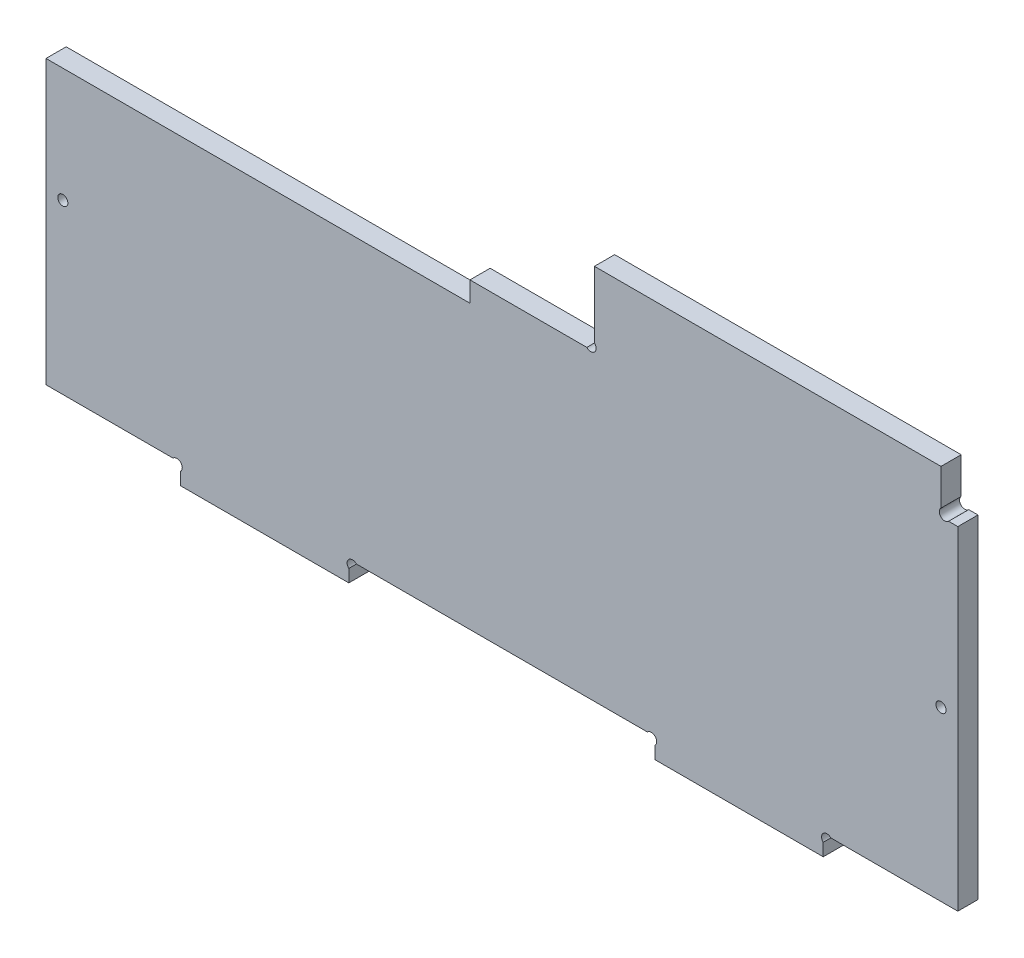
ISO-10303-21;
HEADER;
FILE_DESCRIPTION(('STEP AP214'),'2;1');
FILE_NAME('part.step','',(''),(''),'','','');
FILE_SCHEMA(('AUTOMOTIVE_DESIGN { 1 0 10303 214 1 1 1 1 }'));
ENDSEC;
DATA;
#1=APPLICATION_CONTEXT('core data for automotive mechanical design processes');
#2=APPLICATION_PROTOCOL_DEFINITION('international standard','automotive_design',2000,#1);
#3=PRODUCT_CONTEXT('',#1,'mechanical');
#4=PRODUCT('Part','Part','',(#3));
#5=PRODUCT_RELATED_PRODUCT_CATEGORY('part','',(#4));
#6=PRODUCT_DEFINITION_FORMATION('','',#4);
#7=PRODUCT_DEFINITION_CONTEXT('part definition',#1,'design');
#8=PRODUCT_DEFINITION('design','',#6,#7);
#9=PRODUCT_DEFINITION_SHAPE('','',#8);
#10=(LENGTH_UNIT() NAMED_UNIT(*) SI_UNIT(.MILLI.,.METRE.));
#11=(NAMED_UNIT(*) PLANE_ANGLE_UNIT() SI_UNIT($,.RADIAN.));
#12=(NAMED_UNIT(*) SI_UNIT($,.STERADIAN.) SOLID_ANGLE_UNIT());
#13=UNCERTAINTY_MEASURE_WITH_UNIT(LENGTH_MEASURE(1.E-05),#10,'distance_accuracy_value','');
#14=(GEOMETRIC_REPRESENTATION_CONTEXT(3) GLOBAL_UNCERTAINTY_ASSIGNED_CONTEXT((#13)) GLOBAL_UNIT_ASSIGNED_CONTEXT((#10,
#11,#12)) REPRESENTATION_CONTEXT('',''));
#15=CARTESIAN_POINT('',(0.,0.,0.));
#16=DIRECTION('',(0.,0.,1.));
#17=DIRECTION('',(1.,0.,0.));
#18=AXIS2_PLACEMENT_3D('',#15,#16,#17);
#19=CARTESIAN_POINT('',(0.,0.,6.));
#20=DIRECTION('',(0.,1.,0.));
#21=DIRECTION('',(0.,0.,1.));
#22=AXIS2_PLACEMENT_3D('',#19,#20,#21);
#23=PLANE('',#22);
#24=DIRECTION('',(1.,0.,0.));
#25=VECTOR('',#24,1.);
#26=CARTESIAN_POINT('',(0.,0.,0.));
#27=LINE('',#26,#25);
#28=CARTESIAN_POINT('',(40.,0.,0.));
#29=VERTEX_POINT('',#28);
#30=CARTESIAN_POINT('',(90.,0.,0.));
#31=VERTEX_POINT('',#30);
#32=EDGE_CURVE('E301',#29,#31,#27,.T.);
#33=ORIENTED_EDGE('',*,*,#32,.T.);
#34=DIRECTION('',(0.,0.,1.));
#35=VECTOR('',#34,1.);
#36=CARTESIAN_POINT('',(90.,0.,0.));
#37=LINE('',#36,#35);
#38=CARTESIAN_POINT('',(90.,0.,6.));
#39=VERTEX_POINT('',#38);
#40=EDGE_CURVE('E356',#31,#39,#37,.T.);
#41=ORIENTED_EDGE('',*,*,#40,.T.);
#42=DIRECTION('',(1.,0.,0.));
#43=VECTOR('',#42,1.);
#44=CARTESIAN_POINT('',(0.,0.,6.));
#45=LINE('',#44,#43);
#46=CARTESIAN_POINT('',(40.,0.,6.));
#47=VERTEX_POINT('',#46);
#48=EDGE_CURVE('E223',#47,#39,#45,.T.);
#49=ORIENTED_EDGE('',*,*,#48,.F.);
#50=DIRECTION('',(0.,0.,1.));
#51=VECTOR('',#50,1.);
#52=CARTESIAN_POINT('',(40.,0.,0.));
#53=LINE('',#52,#51);
#54=EDGE_CURVE('E341',#29,#47,#53,.T.);
#55=ORIENTED_EDGE('',*,*,#54,.F.);
#56=EDGE_LOOP('',(#33,#41,#49,#55));
#57=FACE_BOUND('',#56,.T.);
#58=ADVANCED_FACE('F32',(#57),#23,.F.);
#59=CARTESIAN_POINT('',(0.,0.,6.));
#60=DIRECTION('',(1.,0.,0.));
#61=DIRECTION('',(0.,0.,-1.));
#62=AXIS2_PLACEMENT_3D('',#59,#60,#61);
#63=PLANE('',#62);
#64=DIRECTION('',(0.,-1.,0.));
#65=VECTOR('',#64,1.);
#66=CARTESIAN_POINT('',(0.,0.,0.));
#67=LINE('',#66,#65);
#68=CARTESIAN_POINT('',(0.,90.,0.));
#69=VERTEX_POINT('',#68);
#70=CARTESIAN_POINT('',(0.,6.,0.));
#71=VERTEX_POINT('',#70);
#72=EDGE_CURVE('E296',#69,#71,#67,.T.);
#73=ORIENTED_EDGE('',*,*,#72,.T.);
#74=DIRECTION('',(0.,0.,1.));
#75=VECTOR('',#74,1.);
#76=CARTESIAN_POINT('',(0.,6.,0.));
#77=LINE('',#76,#75);
#78=CARTESIAN_POINT('',(0.,6.,6.));
#79=VERTEX_POINT('',#78);
#80=EDGE_CURVE('E339',#71,#79,#77,.T.);
#81=ORIENTED_EDGE('',*,*,#80,.T.);
#82=DIRECTION('',(0.,-1.,0.));
#83=VECTOR('',#82,1.);
#84=CARTESIAN_POINT('',(0.,0.,6.));
#85=LINE('',#84,#83);
#86=CARTESIAN_POINT('',(0.,90.,6.));
#87=VERTEX_POINT('',#86);
#88=EDGE_CURVE('E219',#87,#79,#85,.T.);
#89=ORIENTED_EDGE('',*,*,#88,.F.);
#90=DIRECTION('',(0.,0.,-1.));
#91=VECTOR('',#90,1.);
#92=CARTESIAN_POINT('',(0.,90.,6.));
#93=LINE('',#92,#91);
#94=EDGE_CURVE('E243',#87,#69,#93,.T.);
#95=ORIENTED_EDGE('',*,*,#94,.T.);
#96=EDGE_LOOP('',(#73,#81,#89,#95));
#97=FACE_BOUND('',#96,.T.);
#98=ADVANCED_FACE('F34',(#97),#63,.F.);
#99=CARTESIAN_POINT('',(181.,0.,6.));
#100=VERTEX_POINT('',#99);
#101=CARTESIAN_POINT('',(231.,0.,6.));
#102=VERTEX_POINT('',#101);
#103=EDGE_CURVE('E222',#100,#102,#45,.T.);
#104=ORIENTED_EDGE('',*,*,#103,.F.);
#105=DIRECTION('',(0.,0.,1.));
#106=VECTOR('',#105,1.);
#107=CARTESIAN_POINT('',(181.,0.,0.));
#108=LINE('',#107,#106);
#109=CARTESIAN_POINT('',(181.,0.,0.));
#110=VERTEX_POINT('',#109);
#111=EDGE_CURVE('E355',#110,#100,#108,.T.);
#112=ORIENTED_EDGE('',*,*,#111,.F.);
#113=CARTESIAN_POINT('',(231.,0.,0.));
#114=VERTEX_POINT('',#113);
#115=EDGE_CURVE('E300',#110,#114,#27,.T.);
#116=ORIENTED_EDGE('',*,*,#115,.T.);
#117=DIRECTION('',(0.,0.,1.));
#118=VECTOR('',#117,1.);
#119=CARTESIAN_POINT('',(231.,0.,0.));
#120=LINE('',#119,#118);
#121=EDGE_CURVE('E293',#114,#102,#120,.T.);
#122=ORIENTED_EDGE('',*,*,#121,.T.);
#123=EDGE_LOOP('',(#104,#112,#116,#122));
#124=FACE_BOUND('',#123,.T.);
#125=ADVANCED_FACE('F444',(#124),#23,.F.);
#126=CARTESIAN_POINT('',(271.,0.,6.));
#127=DIRECTION('',(-1.,0.,0.));
#128=DIRECTION('',(0.,0.,1.));
#129=AXIS2_PLACEMENT_3D('',#126,#127,#128);
#130=PLANE('',#129);
#131=DIRECTION('',(0.,1.,0.));
#132=VECTOR('',#131,1.);
#133=CARTESIAN_POINT('',(271.,0.,6.));
#134=LINE('',#133,#132);
#135=CARTESIAN_POINT('',(271.,6.,6.));
#136=VERTEX_POINT('',#135);
#137=CARTESIAN_POINT('',(271.,105.,6.));
#138=VERTEX_POINT('',#137);
#139=EDGE_CURVE('E226',#136,#138,#134,.T.);
#140=ORIENTED_EDGE('',*,*,#139,.F.);
#141=DIRECTION('',(0.,0.,1.));
#142=VECTOR('',#141,1.);
#143=CARTESIAN_POINT('',(271.,6.,0.));
#144=LINE('',#143,#142);
#145=CARTESIAN_POINT('',(271.,6.,0.));
#146=VERTEX_POINT('',#145);
#147=EDGE_CURVE('E288',#146,#136,#144,.T.);
#148=ORIENTED_EDGE('',*,*,#147,.F.);
#149=DIRECTION('',(0.,1.,0.));
#150=VECTOR('',#149,1.);
#151=CARTESIAN_POINT('',(271.,0.,0.));
#152=LINE('',#151,#150);
#153=CARTESIAN_POINT('',(271.,105.,0.));
#154=VERTEX_POINT('',#153);
#155=EDGE_CURVE('E284',#146,#154,#152,.T.);
#156=ORIENTED_EDGE('',*,*,#155,.T.);
#157=DIRECTION('',(0.,0.,-1.));
#158=VECTOR('',#157,1.);
#159=CARTESIAN_POINT('',(271.,105.,6.));
#160=LINE('',#159,#158);
#161=EDGE_CURVE('E257',#138,#154,#160,.T.);
#162=ORIENTED_EDGE('',*,*,#161,.F.);
#163=EDGE_LOOP('',(#140,#148,#156,#162));
#164=FACE_BOUND('',#163,.T.);
#165=ADVANCED_FACE('F336',(#164),#130,.F.);
#166=CARTESIAN_POINT('',(271.,105.,6.));
#167=DIRECTION('',(0.,-1.,0.));
#168=DIRECTION('',(0.,0.,-1.));
#169=AXIS2_PLACEMENT_3D('',#166,#167,#168);
#170=PLANE('',#169);
#171=DIRECTION('',(-1.,0.,0.));
#172=VECTOR('',#171,1.);
#173=CARTESIAN_POINT('',(271.,105.,0.));
#174=LINE('',#173,#172);
#175=CARTESIAN_POINT('',(268.261895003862,105.,0.));
#176=VERTEX_POINT('',#175);
#177=EDGE_CURVE('E305',#154,#176,#174,.T.);
#178=ORIENTED_EDGE('',*,*,#177,.T.);
#179=DIRECTION('',(0.,0.,1.));
#180=VECTOR('',#179,1.);
#181=CARTESIAN_POINT('',(268.261895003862,105.,0.));
#182=LINE('',#181,#180);
#183=CARTESIAN_POINT('',(268.261895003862,105.,6.));
#184=VERTEX_POINT('',#183);
#185=EDGE_CURVE('E54',#176,#184,#182,.T.);
#186=ORIENTED_EDGE('',*,*,#185,.T.);
#187=DIRECTION('',(-1.,0.,0.));
#188=VECTOR('',#187,1.);
#189=CARTESIAN_POINT('',(271.,105.,6.));
#190=LINE('',#189,#188);
#191=EDGE_CURVE('E228',#138,#184,#190,.T.);
#192=ORIENTED_EDGE('',*,*,#191,.F.);
#193=ORIENTED_EDGE('',*,*,#161,.T.);
#194=EDGE_LOOP('',(#178,#186,#192,#193));
#195=FACE_BOUND('',#194,.T.);
#196=ADVANCED_FACE('F331',(#195),#170,.F.);
#197=CARTESIAN_POINT('',(266.,105.,6.));
#198=DIRECTION('',(-1.,0.,0.));
#199=DIRECTION('',(0.,0.,1.));
#200=AXIS2_PLACEMENT_3D('',#197,#198,#199);
#201=PLANE('',#200);
#202=DIRECTION('',(0.,1.,0.));
#203=VECTOR('',#202,1.);
#204=CARTESIAN_POINT('',(266.,105.,6.));
#205=LINE('',#204,#203);
#206=CARTESIAN_POINT('',(266.,107.261895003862,6.));
#207=VERTEX_POINT('',#206);
#208=CARTESIAN_POINT('',(266.,118.,6.));
#209=VERTEX_POINT('',#208);
#210=EDGE_CURVE('E231',#207,#209,#205,.T.);
#211=ORIENTED_EDGE('',*,*,#210,.F.);
#212=DIRECTION('',(0.,0.,1.));
#213=VECTOR('',#212,1.);
#214=CARTESIAN_POINT('',(266.,107.261895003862,0.));
#215=LINE('',#214,#213);
#216=CARTESIAN_POINT('',(266.,107.261895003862,0.));
#217=VERTEX_POINT('',#216);
#218=EDGE_CURVE('E327',#207,#217,#215,.F.);
#219=ORIENTED_EDGE('',*,*,#218,.T.);
#220=DIRECTION('',(0.,1.,0.));
#221=VECTOR('',#220,1.);
#222=CARTESIAN_POINT('',(266.,105.,0.));
#223=LINE('',#222,#221);
#224=CARTESIAN_POINT('',(266.,118.,0.));
#225=VERTEX_POINT('',#224);
#226=EDGE_CURVE('E308',#217,#225,#223,.T.);
#227=ORIENTED_EDGE('',*,*,#226,.T.);
#228=DIRECTION('',(0.,0.,-1.));
#229=VECTOR('',#228,1.);
#230=CARTESIAN_POINT('',(266.,118.,6.));
#231=LINE('',#230,#229);
#232=EDGE_CURVE('E254',#209,#225,#231,.T.);
#233=ORIENTED_EDGE('',*,*,#232,.F.);
#234=EDGE_LOOP('',(#211,#219,#227,#233));
#235=FACE_BOUND('',#234,.T.);
#236=ADVANCED_FACE('F326',(#235),#201,.F.);
#237=CARTESIAN_POINT('',(266.,118.,6.));
#238=DIRECTION('',(0.,-1.,0.));
#239=DIRECTION('',(1.,0.,0.));
#240=AXIS2_PLACEMENT_3D('',#237,#238,#239);
#241=PLANE('',#240);
#242=DIRECTION('',(-1.,0.,0.));
#243=VECTOR('',#242,1.);
#244=CARTESIAN_POINT('',(266.,118.,0.));
#245=LINE('',#244,#243);
#246=CARTESIAN_POINT('',(163.,118.,0.));
#247=VERTEX_POINT('',#246);
#248=EDGE_CURVE('E214',#225,#247,#245,.T.);
#249=ORIENTED_EDGE('',*,*,#248,.T.);
#250=DIRECTION('',(0.,0.,-1.));
#251=VECTOR('',#250,1.);
#252=CARTESIAN_POINT('',(163.,118.,6.));
#253=LINE('',#252,#251);
#254=CARTESIAN_POINT('',(163.,118.,6.));
#255=VERTEX_POINT('',#254);
#256=EDGE_CURVE('E251',#255,#247,#253,.T.);
#257=ORIENTED_EDGE('',*,*,#256,.F.);
#258=DIRECTION('',(-1.,0.,0.));
#259=VECTOR('',#258,1.);
#260=CARTESIAN_POINT('',(266.,118.,6.));
#261=LINE('',#260,#259);
#262=EDGE_CURVE('E233',#209,#255,#261,.T.);
#263=ORIENTED_EDGE('',*,*,#262,.F.);
#264=ORIENTED_EDGE('',*,*,#232,.T.);
#265=EDGE_LOOP('',(#249,#257,#263,#264));
#266=FACE_BOUND('',#265,.T.);
#267=ADVANCED_FACE('F312',(#266),#241,.F.);
#268=CARTESIAN_POINT('',(163.,118.,6.));
#269=DIRECTION('',(1.,0.,0.));
#270=DIRECTION('',(0.,0.,-1.));
#271=AXIS2_PLACEMENT_3D('',#268,#269,#270);
#272=PLANE('',#271);
#273=DIRECTION('',(0.,-1.,0.));
#274=VECTOR('',#273,1.);
#275=CARTESIAN_POINT('',(163.,118.,0.));
#276=LINE('',#275,#274);
#277=CARTESIAN_POINT('',(163.,98.2618950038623,0.));
#278=VERTEX_POINT('',#277);
#279=EDGE_CURVE('E210',#247,#278,#276,.T.);
#280=ORIENTED_EDGE('',*,*,#279,.T.);
#281=DIRECTION('',(0.,0.,1.));
#282=VECTOR('',#281,1.);
#283=CARTESIAN_POINT('',(163.,98.2618950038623,0.));
#284=LINE('',#283,#282);
#285=CARTESIAN_POINT('',(163.,98.2618950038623,6.));
#286=VERTEX_POINT('',#285);
#287=EDGE_CURVE('E47',#278,#286,#284,.T.);
#288=ORIENTED_EDGE('',*,*,#287,.T.);
#289=DIRECTION('',(0.,-1.,0.));
#290=VECTOR('',#289,1.);
#291=CARTESIAN_POINT('',(163.,118.,6.));
#292=LINE('',#291,#290);
#293=EDGE_CURVE('E235',#255,#286,#292,.T.);
#294=ORIENTED_EDGE('',*,*,#293,.F.);
#295=ORIENTED_EDGE('',*,*,#256,.T.);
#296=EDGE_LOOP('',(#280,#288,#294,#295));
#297=FACE_BOUND('',#296,.T.);
#298=ADVANCED_FACE('F318',(#297),#272,.F.);
#299=CARTESIAN_POINT('',(163.,96.,6.));
#300=DIRECTION('',(0.,-1.,0.));
#301=DIRECTION('',(0.,0.,-1.));
#302=AXIS2_PLACEMENT_3D('',#299,#300,#301);
#303=PLANE('',#302);
#304=DIRECTION('',(-1.,0.,0.));
#305=VECTOR('',#304,1.);
#306=CARTESIAN_POINT('',(163.,96.,6.));
#307=LINE('',#306,#305);
#308=CARTESIAN_POINT('',(160.738104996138,96.,6.));
#309=VERTEX_POINT('',#308);
#310=CARTESIAN_POINT('',(126.,96.,6.));
#311=VERTEX_POINT('',#310);
#312=EDGE_CURVE('E203',#309,#311,#307,.T.);
#313=ORIENTED_EDGE('',*,*,#312,.F.);
#314=DIRECTION('',(0.,0.,1.));
#315=VECTOR('',#314,1.);
#316=CARTESIAN_POINT('',(160.738104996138,96.,0.));
#317=LINE('',#316,#315);
#318=CARTESIAN_POINT('',(160.738104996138,96.,0.));
#319=VERTEX_POINT('',#318);
#320=EDGE_CURVE('E191',#309,#319,#317,.F.);
#321=ORIENTED_EDGE('',*,*,#320,.T.);
#322=DIRECTION('',(-1.,0.,0.));
#323=VECTOR('',#322,1.);
#324=CARTESIAN_POINT('',(163.,96.,0.));
#325=LINE('',#324,#323);
#326=CARTESIAN_POINT('',(126.,96.,0.));
#327=VERTEX_POINT('',#326);
#328=EDGE_CURVE('E201',#319,#327,#325,.T.);
#329=ORIENTED_EDGE('',*,*,#328,.T.);
#330=DIRECTION('',(0.,0.,-1.));
#331=VECTOR('',#330,1.);
#332=CARTESIAN_POINT('',(126.,96.,6.));
#333=LINE('',#332,#331);
#334=EDGE_CURVE('E249',#311,#327,#333,.T.);
#335=ORIENTED_EDGE('',*,*,#334,.F.);
#336=EDGE_LOOP('',(#313,#321,#329,#335));
#337=FACE_BOUND('',#336,.T.);
#338=ADVANCED_FACE('F199',(#337),#303,.F.);
#339=CARTESIAN_POINT('',(126.,96.,6.));
#340=DIRECTION('',(1.,0.,0.));
#341=DIRECTION('',(0.,0.,-1.));
#342=AXIS2_PLACEMENT_3D('',#339,#340,#341);
#343=PLANE('',#342);
#344=DIRECTION('',(0.,-1.,0.));
#345=VECTOR('',#344,1.);
#346=CARTESIAN_POINT('',(126.,96.,0.));
#347=LINE('',#346,#345);
#348=CARTESIAN_POINT('',(126.,90.,0.));
#349=VERTEX_POINT('',#348);
#350=EDGE_CURVE('E209',#327,#349,#347,.T.);
#351=ORIENTED_EDGE('',*,*,#350,.T.);
#352=DIRECTION('',(0.,0.,-1.));
#353=VECTOR('',#352,1.);
#354=CARTESIAN_POINT('',(126.,90.,6.));
#355=LINE('',#354,#353);
#356=CARTESIAN_POINT('',(126.,90.,6.));
#357=VERTEX_POINT('',#356);
#358=EDGE_CURVE('E246',#357,#349,#355,.T.);
#359=ORIENTED_EDGE('',*,*,#358,.F.);
#360=DIRECTION('',(0.,-1.,0.));
#361=VECTOR('',#360,1.);
#362=CARTESIAN_POINT('',(126.,96.,6.));
#363=LINE('',#362,#361);
#364=EDGE_CURVE('E239',#311,#357,#363,.T.);
#365=ORIENTED_EDGE('',*,*,#364,.F.);
#366=ORIENTED_EDGE('',*,*,#334,.T.);
#367=EDGE_LOOP('',(#351,#359,#365,#366));
#368=FACE_BOUND('',#367,.T.);
#369=ADVANCED_FACE('F516',(#368),#343,.F.);
#370=CARTESIAN_POINT('',(126.,90.,6.));
#371=DIRECTION('',(0.,-1.,0.));
#372=DIRECTION('',(0.,0.,-1.));
#373=AXIS2_PLACEMENT_3D('',#370,#371,#372);
#374=PLANE('',#373);
#375=DIRECTION('',(-1.,0.,0.));
#376=VECTOR('',#375,1.);
#377=CARTESIAN_POINT('',(126.,90.,0.));
#378=LINE('',#377,#376);
#379=EDGE_CURVE('E212',#349,#69,#378,.T.);
#380=ORIENTED_EDGE('',*,*,#379,.T.);
#381=ORIENTED_EDGE('',*,*,#94,.F.);
#382=DIRECTION('',(-1.,0.,0.));
#383=VECTOR('',#382,1.);
#384=CARTESIAN_POINT('',(126.,90.,6.));
#385=LINE('',#384,#383);
#386=EDGE_CURVE('E241',#357,#87,#385,.T.);
#387=ORIENTED_EDGE('',*,*,#386,.F.);
#388=ORIENTED_EDGE('',*,*,#358,.T.);
#389=EDGE_LOOP('',(#380,#381,#387,#388));
#390=FACE_BOUND('',#389,.T.);
#391=ADVANCED_FACE('F425',(#390),#374,.F.);
#392=CARTESIAN_POINT('',(0.,90.,6.));
#393=DIRECTION('',(0.,0.,1.));
#394=DIRECTION('',(1.,0.,0.));
#395=AXIS2_PLACEMENT_3D('',#392,#393,#394);
#396=PLANE('',#395);
#397=CARTESIAN_POINT('',(5.,56.,6.));
#398=DIRECTION('',(0.,0.,1.));
#399=DIRECTION('',(1.,0.,0.));
#400=AXIS2_PLACEMENT_3D('',#397,#398,#399);
#401=CIRCLE('',#400,1.5);
#402=CARTESIAN_POINT('',(6.5,56.,6.));
#403=VERTEX_POINT('',#402);
#404=EDGE_CURVE('E417',#403,#403,#401,.T.);
#405=ORIENTED_EDGE('',*,*,#404,.F.);
#406=EDGE_LOOP('',(#405));
#407=FACE_BOUND('',#406,.T.);
#408=CARTESIAN_POINT('',(266.,56.,6.));
#409=DIRECTION('',(0.,0.,1.));
#410=DIRECTION('',(1.,0.,0.));
#411=AXIS2_PLACEMENT_3D('',#408,#409,#410);
#412=CIRCLE('',#411,1.50000000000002);
#413=CARTESIAN_POINT('',(267.5,56.,6.));
#414=VERTEX_POINT('',#413);
#415=EDGE_CURVE('E411',#414,#414,#412,.T.);
#416=ORIENTED_EDGE('',*,*,#415,.F.);
#417=EDGE_LOOP('',(#416));
#418=FACE_BOUND('',#417,.T.);
#419=CARTESIAN_POINT('',(161.9,97.1,6.));
#420=DIRECTION('',(0.,0.,1.));
#421=DIRECTION('',(1.,0.,0.));
#422=AXIS2_PLACEMENT_3D('',#419,#420,#421);
#423=CIRCLE('',#422,1.59999999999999);
#424=EDGE_CURVE('E204',#309,#286,#423,.T.);
#425=ORIENTED_EDGE('',*,*,#424,.F.);
#426=ORIENTED_EDGE('',*,*,#312,.T.);
#427=ORIENTED_EDGE('',*,*,#364,.T.);
#428=ORIENTED_EDGE('',*,*,#386,.T.);
#429=ORIENTED_EDGE('',*,*,#88,.T.);
#430=DIRECTION('',(-1.,0.,0.));
#431=VECTOR('',#430,1.);
#432=CARTESIAN_POINT('',(0.,6.,6.));
#433=LINE('',#432,#431);
#434=CARTESIAN_POINT('',(37.7381049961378,6.,6.));
#435=VERTEX_POINT('',#434);
#436=EDGE_CURVE('E350',#435,#79,#433,.T.);
#437=ORIENTED_EDGE('',*,*,#436,.F.);
#438=CARTESIAN_POINT('',(38.9,4.9,6.));
#439=DIRECTION('',(0.,0.,1.));
#440=DIRECTION('',(1.,0.,0.));
#441=AXIS2_PLACEMENT_3D('',#438,#439,#440);
#442=CIRCLE('',#441,1.6);
#443=CARTESIAN_POINT('',(40.,3.73810499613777,6.));
#444=VERTEX_POINT('',#443);
#445=EDGE_CURVE('E380',#444,#435,#442,.T.);
#446=ORIENTED_EDGE('',*,*,#445,.F.);
#447=DIRECTION('',(0.,1.,0.));
#448=VECTOR('',#447,1.);
#449=CARTESIAN_POINT('',(40.,0.,6.));
#450=LINE('',#449,#448);
#451=EDGE_CURVE('E352',#47,#444,#450,.T.);
#452=ORIENTED_EDGE('',*,*,#451,.F.);
#453=ORIENTED_EDGE('',*,*,#48,.T.);
#454=DIRECTION('',(0.,-1.,0.));
#455=VECTOR('',#454,1.);
#456=CARTESIAN_POINT('',(90.,6.,6.));
#457=LINE('',#456,#455);
#458=CARTESIAN_POINT('',(90.,3.73810499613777,6.));
#459=VERTEX_POINT('',#458);
#460=EDGE_CURVE('E372',#459,#39,#457,.T.);
#461=ORIENTED_EDGE('',*,*,#460,.F.);
#462=CARTESIAN_POINT('',(91.1,4.9,6.));
#463=DIRECTION('',(0.,0.,1.));
#464=DIRECTION('',(1.,0.,0.));
#465=AXIS2_PLACEMENT_3D('',#462,#463,#464);
#466=CIRCLE('',#465,1.60000000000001);
#467=CARTESIAN_POINT('',(92.2618950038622,6.,6.));
#468=VERTEX_POINT('',#467);
#469=EDGE_CURVE('E388',#468,#459,#466,.T.);
#470=ORIENTED_EDGE('',*,*,#469,.F.);
#471=DIRECTION('',(-1.,0.,0.));
#472=VECTOR('',#471,1.);
#473=CARTESIAN_POINT('',(90.,6.,6.));
#474=LINE('',#473,#472);
#475=CARTESIAN_POINT('',(178.738104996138,6.,6.));
#476=VERTEX_POINT('',#475);
#477=EDGE_CURVE('E367',#476,#468,#474,.T.);
#478=ORIENTED_EDGE('',*,*,#477,.F.);
#479=CARTESIAN_POINT('',(179.9,4.9,6.));
#480=DIRECTION('',(0.,0.,1.));
#481=DIRECTION('',(1.,0.,0.));
#482=AXIS2_PLACEMENT_3D('',#479,#480,#481);
#483=CIRCLE('',#482,1.59999999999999);
#484=CARTESIAN_POINT('',(181.,3.73810499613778,6.));
#485=VERTEX_POINT('',#484);
#486=EDGE_CURVE('E396',#485,#476,#483,.T.);
#487=ORIENTED_EDGE('',*,*,#486,.F.);
#488=DIRECTION('',(0.,1.,0.));
#489=VECTOR('',#488,1.);
#490=CARTESIAN_POINT('',(181.,6.,6.));
#491=LINE('',#490,#489);
#492=EDGE_CURVE('E369',#100,#485,#491,.T.);
#493=ORIENTED_EDGE('',*,*,#492,.F.);
#494=ORIENTED_EDGE('',*,*,#103,.T.);
#495=DIRECTION('',(0.,-1.,0.));
#496=VECTOR('',#495,1.);
#497=CARTESIAN_POINT('',(231.,0.,6.));
#498=LINE('',#497,#496);
#499=CARTESIAN_POINT('',(231.,3.73810499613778,6.));
#500=VERTEX_POINT('',#499);
#501=EDGE_CURVE('E286',#500,#102,#498,.T.);
#502=ORIENTED_EDGE('',*,*,#501,.F.);
#503=CARTESIAN_POINT('',(232.1,4.9,6.));
#504=DIRECTION('',(0.,0.,1.));
#505=DIRECTION('',(1.,0.,0.));
#506=AXIS2_PLACEMENT_3D('',#503,#504,#505);
#507=CIRCLE('',#506,1.59999999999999);
#508=CARTESIAN_POINT('',(233.261895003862,5.99999999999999,6.));
#509=VERTEX_POINT('',#508);
#510=EDGE_CURVE('E338',#509,#500,#507,.T.);
#511=ORIENTED_EDGE('',*,*,#510,.F.);
#512=DIRECTION('',(-1.,0.,0.));
#513=VECTOR('',#512,1.);
#514=CARTESIAN_POINT('',(271.,6.,6.));
#515=LINE('',#514,#513);
#516=EDGE_CURVE('E276',#136,#509,#515,.T.);
#517=ORIENTED_EDGE('',*,*,#516,.F.);
#518=ORIENTED_EDGE('',*,*,#139,.T.);
#519=ORIENTED_EDGE('',*,*,#191,.T.);
#520=CARTESIAN_POINT('',(267.1,106.1,6.));
#521=DIRECTION('',(0.,0.,1.));
#522=DIRECTION('',(1.,0.,0.));
#523=AXIS2_PLACEMENT_3D('',#520,#521,#522);
#524=CIRCLE('',#523,1.59999999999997);
#525=EDGE_CURVE('E323',#207,#184,#524,.T.);
#526=ORIENTED_EDGE('',*,*,#525,.F.);
#527=ORIENTED_EDGE('',*,*,#210,.T.);
#528=ORIENTED_EDGE('',*,*,#262,.T.);
#529=ORIENTED_EDGE('',*,*,#293,.T.);
#530=EDGE_LOOP('',(#425,#426,#427,#428,#429,#437,#446,#452,#453,#461,#470,#478,#487,#493,#494,
#502,#511,#517,#518,#519,#526,#527,#528,#529));
#531=FACE_BOUND('',#530,.T.);
#532=ADVANCED_FACE('F320',(#407,#418,#531),#396,.T.);
#533=CARTESIAN_POINT('',(0.,90.,0.));
#534=DIRECTION('',(0.,0.,1.));
#535=DIRECTION('',(1.,0.,0.));
#536=AXIS2_PLACEMENT_3D('',#533,#534,#535);
#537=PLANE('',#536);
#538=CARTESIAN_POINT('',(5.,56.,0.));
#539=DIRECTION('',(0.,0.,1.));
#540=DIRECTION('',(1.,0.,0.));
#541=AXIS2_PLACEMENT_3D('',#538,#539,#540);
#542=CIRCLE('',#541,1.5);
#543=CARTESIAN_POINT('',(6.5,56.,0.));
#544=VERTEX_POINT('',#543);
#545=EDGE_CURVE('E414',#544,#544,#542,.T.);
#546=ORIENTED_EDGE('',*,*,#545,.T.);
#547=EDGE_LOOP('',(#546));
#548=FACE_BOUND('',#547,.T.);
#549=CARTESIAN_POINT('',(266.,56.,0.));
#550=DIRECTION('',(0.,0.,1.));
#551=DIRECTION('',(1.,0.,0.));
#552=AXIS2_PLACEMENT_3D('',#549,#550,#551);
#553=CIRCLE('',#552,1.50000000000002);
#554=CARTESIAN_POINT('',(267.5,56.,0.));
#555=VERTEX_POINT('',#554);
#556=EDGE_CURVE('E408',#555,#555,#553,.T.);
#557=ORIENTED_EDGE('',*,*,#556,.T.);
#558=EDGE_LOOP('',(#557));
#559=FACE_BOUND('',#558,.T.);
#560=ORIENTED_EDGE('',*,*,#328,.F.);
#561=CARTESIAN_POINT('',(161.9,97.1,0.));
#562=DIRECTION('',(0.,0.,1.));
#563=DIRECTION('',(1.,0.,0.));
#564=AXIS2_PLACEMENT_3D('',#561,#562,#563);
#565=CIRCLE('',#564,1.59999999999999);
#566=EDGE_CURVE('E11',#319,#278,#565,.T.);
#567=ORIENTED_EDGE('',*,*,#566,.T.);
#568=ORIENTED_EDGE('',*,*,#279,.F.);
#569=ORIENTED_EDGE('',*,*,#248,.F.);
#570=ORIENTED_EDGE('',*,*,#226,.F.);
#571=CARTESIAN_POINT('',(267.1,106.1,0.));
#572=DIRECTION('',(0.,0.,1.));
#573=DIRECTION('',(1.,0.,0.));
#574=AXIS2_PLACEMENT_3D('',#571,#572,#573);
#575=CIRCLE('',#574,1.59999999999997);
#576=EDGE_CURVE('E328',#217,#176,#575,.T.);
#577=ORIENTED_EDGE('',*,*,#576,.T.);
#578=ORIENTED_EDGE('',*,*,#177,.F.);
#579=ORIENTED_EDGE('',*,*,#155,.F.);
#580=DIRECTION('',(-1.,0.,0.));
#581=VECTOR('',#580,1.);
#582=CARTESIAN_POINT('',(271.,6.,0.));
#583=LINE('',#582,#581);
#584=CARTESIAN_POINT('',(233.261895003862,5.99999999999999,0.));
#585=VERTEX_POINT('',#584);
#586=EDGE_CURVE('E273',#146,#585,#583,.T.);
#587=ORIENTED_EDGE('',*,*,#586,.T.);
#588=CARTESIAN_POINT('',(232.1,4.9,0.));
#589=DIRECTION('',(0.,0.,1.));
#590=DIRECTION('',(1.,0.,0.));
#591=AXIS2_PLACEMENT_3D('',#588,#589,#590);
#592=CIRCLE('',#591,1.59999999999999);
#593=CARTESIAN_POINT('',(231.,3.73810499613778,0.));
#594=VERTEX_POINT('',#593);
#595=EDGE_CURVE('E281',#585,#594,#592,.T.);
#596=ORIENTED_EDGE('',*,*,#595,.T.);
#597=DIRECTION('',(0.,-1.,0.));
#598=VECTOR('',#597,1.);
#599=CARTESIAN_POINT('',(231.,0.,0.));
#600=LINE('',#599,#598);
#601=EDGE_CURVE('E285',#594,#114,#600,.T.);
#602=ORIENTED_EDGE('',*,*,#601,.T.);
#603=ORIENTED_EDGE('',*,*,#115,.F.);
#604=DIRECTION('',(0.,1.,0.));
#605=VECTOR('',#604,1.);
#606=CARTESIAN_POINT('',(181.,6.,0.));
#607=LINE('',#606,#605);
#608=CARTESIAN_POINT('',(181.,3.73810499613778,0.));
#609=VERTEX_POINT('',#608);
#610=EDGE_CURVE('E362',#110,#609,#607,.T.);
#611=ORIENTED_EDGE('',*,*,#610,.T.);
#612=CARTESIAN_POINT('',(179.9,4.9,0.));
#613=DIRECTION('',(0.,0.,1.));
#614=DIRECTION('',(1.,0.,0.));
#615=AXIS2_PLACEMENT_3D('',#612,#613,#614);
#616=CIRCLE('',#615,1.59999999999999);
#617=CARTESIAN_POINT('',(178.738104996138,6.,0.));
#618=VERTEX_POINT('',#617);
#619=EDGE_CURVE('E393',#609,#618,#616,.T.);
#620=ORIENTED_EDGE('',*,*,#619,.T.);
#621=DIRECTION('',(-1.,0.,0.));
#622=VECTOR('',#621,1.);
#623=CARTESIAN_POINT('',(90.,6.,0.));
#624=LINE('',#623,#622);
#625=CARTESIAN_POINT('',(92.2618950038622,6.,0.));
#626=VERTEX_POINT('',#625);
#627=EDGE_CURVE('E359',#618,#626,#624,.T.);
#628=ORIENTED_EDGE('',*,*,#627,.T.);
#629=CARTESIAN_POINT('',(91.1,4.9,0.));
#630=DIRECTION('',(0.,0.,1.));
#631=DIRECTION('',(1.,0.,0.));
#632=AXIS2_PLACEMENT_3D('',#629,#630,#631);
#633=CIRCLE('',#632,1.60000000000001);
#634=CARTESIAN_POINT('',(90.,3.73810499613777,0.));
#635=VERTEX_POINT('',#634);
#636=EDGE_CURVE('E385',#626,#635,#633,.T.);
#637=ORIENTED_EDGE('',*,*,#636,.T.);
#638=DIRECTION('',(0.,-1.,0.));
#639=VECTOR('',#638,1.);
#640=CARTESIAN_POINT('',(90.,6.,0.));
#641=LINE('',#640,#639);
#642=EDGE_CURVE('E365',#635,#31,#641,.T.);
#643=ORIENTED_EDGE('',*,*,#642,.T.);
#644=ORIENTED_EDGE('',*,*,#32,.F.);
#645=DIRECTION('',(0.,1.,0.));
#646=VECTOR('',#645,1.);
#647=CARTESIAN_POINT('',(40.,0.,0.));
#648=LINE('',#647,#646);
#649=CARTESIAN_POINT('',(40.,3.73810499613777,0.));
#650=VERTEX_POINT('',#649);
#651=EDGE_CURVE('E347',#29,#650,#648,.T.);
#652=ORIENTED_EDGE('',*,*,#651,.T.);
#653=CARTESIAN_POINT('',(38.9,4.9,0.));
#654=DIRECTION('',(0.,0.,1.));
#655=DIRECTION('',(1.,0.,0.));
#656=AXIS2_PLACEMENT_3D('',#653,#654,#655);
#657=CIRCLE('',#656,1.6);
#658=CARTESIAN_POINT('',(37.7381049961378,6.,0.));
#659=VERTEX_POINT('',#658);
#660=EDGE_CURVE('E377',#650,#659,#657,.T.);
#661=ORIENTED_EDGE('',*,*,#660,.T.);
#662=DIRECTION('',(-1.,0.,0.));
#663=VECTOR('',#662,1.);
#664=CARTESIAN_POINT('',(0.,6.,0.));
#665=LINE('',#664,#663);
#666=EDGE_CURVE('E344',#659,#71,#665,.T.);
#667=ORIENTED_EDGE('',*,*,#666,.T.);
#668=ORIENTED_EDGE('',*,*,#72,.F.);
#669=ORIENTED_EDGE('',*,*,#379,.F.);
#670=ORIENTED_EDGE('',*,*,#350,.F.);
#671=EDGE_LOOP('',(#560,#567,#568,#569,#570,#577,#578,#579,#587,#596,#602,#603,#611,#620,#628,
#637,#643,#644,#652,#661,#667,#668,#669,#670));
#672=FACE_BOUND('',#671,.T.);
#673=ADVANCED_FACE('F207',(#548,#559,#672),#537,.F.);
#674=CARTESIAN_POINT('',(231.,0.,0.));
#675=DIRECTION('',(-1.,0.,0.));
#676=DIRECTION('',(0.,0.,1.));
#677=AXIS2_PLACEMENT_3D('',#674,#675,#676);
#678=PLANE('',#677);
#679=ORIENTED_EDGE('',*,*,#601,.F.);
#680=DIRECTION('',(0.,0.,1.));
#681=VECTOR('',#680,1.);
#682=CARTESIAN_POINT('',(231.,3.73810499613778,0.));
#683=LINE('',#682,#681);
#684=EDGE_CURVE('E398',#594,#500,#683,.T.);
#685=ORIENTED_EDGE('',*,*,#684,.T.);
#686=ORIENTED_EDGE('',*,*,#501,.T.);
#687=ORIENTED_EDGE('',*,*,#121,.F.);
#688=EDGE_LOOP('',(#679,#685,#686,#687));
#689=FACE_BOUND('',#688,.T.);
#690=ADVANCED_FACE('F468',(#689),#678,.F.);
#691=CARTESIAN_POINT('',(271.,6.,0.));
#692=DIRECTION('',(0.,1.,0.));
#693=DIRECTION('',(-1.,0.,0.));
#694=AXIS2_PLACEMENT_3D('',#691,#692,#693);
#695=PLANE('',#694);
#696=ORIENTED_EDGE('',*,*,#516,.T.);
#697=DIRECTION('',(0.,0.,1.));
#698=VECTOR('',#697,1.);
#699=CARTESIAN_POINT('',(233.261895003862,5.99999999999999,0.));
#700=LINE('',#699,#698);
#701=EDGE_CURVE('E40',#509,#585,#700,.F.);
#702=ORIENTED_EDGE('',*,*,#701,.T.);
#703=ORIENTED_EDGE('',*,*,#586,.F.);
#704=ORIENTED_EDGE('',*,*,#147,.T.);
#705=EDGE_LOOP('',(#696,#702,#703,#704));
#706=FACE_BOUND('',#705,.T.);
#707=ADVANCED_FACE('F272',(#706),#695,.F.);
#708=CARTESIAN_POINT('',(0.,6.,0.));
#709=DIRECTION('',(0.,1.,0.));
#710=DIRECTION('',(0.,0.,1.));
#711=AXIS2_PLACEMENT_3D('',#708,#709,#710);
#712=PLANE('',#711);
#713=ORIENTED_EDGE('',*,*,#666,.F.);
#714=DIRECTION('',(0.,0.,1.));
#715=VECTOR('',#714,1.);
#716=CARTESIAN_POINT('',(37.7381049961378,6.,0.));
#717=LINE('',#716,#715);
#718=EDGE_CURVE('E374',#659,#435,#717,.T.);
#719=ORIENTED_EDGE('',*,*,#718,.T.);
#720=ORIENTED_EDGE('',*,*,#436,.T.);
#721=ORIENTED_EDGE('',*,*,#80,.F.);
#722=EDGE_LOOP('',(#713,#719,#720,#721));
#723=FACE_BOUND('',#722,.T.);
#724=ADVANCED_FACE('F500',(#723),#712,.F.);
#725=CARTESIAN_POINT('',(40.,0.,0.));
#726=DIRECTION('',(1.,0.,0.));
#727=DIRECTION('',(0.,0.,-1.));
#728=AXIS2_PLACEMENT_3D('',#725,#726,#727);
#729=PLANE('',#728);
#730=ORIENTED_EDGE('',*,*,#451,.T.);
#731=DIRECTION('',(0.,0.,1.));
#732=VECTOR('',#731,1.);
#733=CARTESIAN_POINT('',(40.,3.73810499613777,0.));
#734=LINE('',#733,#732);
#735=EDGE_CURVE('E260',#444,#650,#734,.F.);
#736=ORIENTED_EDGE('',*,*,#735,.T.);
#737=ORIENTED_EDGE('',*,*,#651,.F.);
#738=ORIENTED_EDGE('',*,*,#54,.T.);
#739=EDGE_LOOP('',(#730,#736,#737,#738));
#740=FACE_BOUND('',#739,.T.);
#741=ADVANCED_FACE('F498',(#740),#729,.F.);
#742=CARTESIAN_POINT('',(90.,6.,0.));
#743=DIRECTION('',(-1.,0.,0.));
#744=DIRECTION('',(0.,0.,1.));
#745=AXIS2_PLACEMENT_3D('',#742,#743,#744);
#746=PLANE('',#745);
#747=ORIENTED_EDGE('',*,*,#642,.F.);
#748=DIRECTION('',(0.,0.,1.));
#749=VECTOR('',#748,1.);
#750=CARTESIAN_POINT('',(90.,3.73810499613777,0.));
#751=LINE('',#750,#749);
#752=EDGE_CURVE('E382',#635,#459,#751,.T.);
#753=ORIENTED_EDGE('',*,*,#752,.T.);
#754=ORIENTED_EDGE('',*,*,#460,.T.);
#755=ORIENTED_EDGE('',*,*,#40,.F.);
#756=EDGE_LOOP('',(#747,#753,#754,#755));
#757=FACE_BOUND('',#756,.T.);
#758=ADVANCED_FACE('F492',(#757),#746,.F.);
#759=CARTESIAN_POINT('',(90.,6.,0.));
#760=DIRECTION('',(0.,1.,0.));
#761=DIRECTION('',(0.,0.,1.));
#762=AXIS2_PLACEMENT_3D('',#759,#760,#761);
#763=PLANE('',#762);
#764=ORIENTED_EDGE('',*,*,#627,.F.);
#765=DIRECTION('',(0.,0.,1.));
#766=VECTOR('',#765,1.);
#767=CARTESIAN_POINT('',(178.738104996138,6.,0.));
#768=LINE('',#767,#766);
#769=EDGE_CURVE('E390',#618,#476,#768,.T.);
#770=ORIENTED_EDGE('',*,*,#769,.T.);
#771=ORIENTED_EDGE('',*,*,#477,.T.);
#772=DIRECTION('',(0.,0.,1.));
#773=VECTOR('',#772,1.);
#774=CARTESIAN_POINT('',(92.2618950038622,6.,0.));
#775=LINE('',#774,#773);
#776=EDGE_CURVE('E263',#468,#626,#775,.F.);
#777=ORIENTED_EDGE('',*,*,#776,.T.);
#778=EDGE_LOOP('',(#764,#770,#771,#777));
#779=FACE_BOUND('',#778,.T.);
#780=ADVANCED_FACE('F489',(#779),#763,.F.);
#781=CARTESIAN_POINT('',(181.,6.,0.));
#782=DIRECTION('',(1.,0.,0.));
#783=DIRECTION('',(0.,0.,-1.));
#784=AXIS2_PLACEMENT_3D('',#781,#782,#783);
#785=PLANE('',#784);
#786=ORIENTED_EDGE('',*,*,#492,.T.);
#787=DIRECTION('',(0.,0.,1.));
#788=VECTOR('',#787,1.);
#789=CARTESIAN_POINT('',(181.,3.73810499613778,0.));
#790=LINE('',#789,#788);
#791=EDGE_CURVE('E266',#485,#609,#790,.F.);
#792=ORIENTED_EDGE('',*,*,#791,.T.);
#793=ORIENTED_EDGE('',*,*,#610,.F.);
#794=ORIENTED_EDGE('',*,*,#111,.T.);
#795=EDGE_LOOP('',(#786,#792,#793,#794));
#796=FACE_BOUND('',#795,.T.);
#797=ADVANCED_FACE('F465',(#796),#785,.F.);
#798=CARTESIAN_POINT('',(38.9,4.9,0.));
#799=DIRECTION('',(0.,0.,1.));
#800=DIRECTION('',(1.,0.,0.));
#801=AXIS2_PLACEMENT_3D('',#798,#799,#800);
#802=CYLINDRICAL_SURFACE('',#801,1.6);
#803=ORIENTED_EDGE('',*,*,#660,.F.);
#804=ORIENTED_EDGE('',*,*,#735,.F.);
#805=ORIENTED_EDGE('',*,*,#445,.T.);
#806=ORIENTED_EDGE('',*,*,#718,.F.);
#807=EDGE_LOOP('',(#803,#804,#805,#806));
#808=FACE_BOUND('',#807,.T.);
#809=ADVANCED_FACE('F484',(#808),#802,.F.);
#810=CARTESIAN_POINT('',(91.1,4.9,0.));
#811=DIRECTION('',(0.,0.,1.));
#812=DIRECTION('',(1.,0.,0.));
#813=AXIS2_PLACEMENT_3D('',#810,#811,#812);
#814=CYLINDRICAL_SURFACE('',#813,1.60000000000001);
#815=ORIENTED_EDGE('',*,*,#636,.F.);
#816=ORIENTED_EDGE('',*,*,#776,.F.);
#817=ORIENTED_EDGE('',*,*,#469,.T.);
#818=ORIENTED_EDGE('',*,*,#752,.F.);
#819=EDGE_LOOP('',(#815,#816,#817,#818));
#820=FACE_BOUND('',#819,.T.);
#821=ADVANCED_FACE('F478',(#820),#814,.F.);
#822=CARTESIAN_POINT('',(179.9,4.9,0.));
#823=DIRECTION('',(0.,0.,1.));
#824=DIRECTION('',(1.,0.,0.));
#825=AXIS2_PLACEMENT_3D('',#822,#823,#824);
#826=CYLINDRICAL_SURFACE('',#825,1.59999999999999);
#827=ORIENTED_EDGE('',*,*,#619,.F.);
#828=ORIENTED_EDGE('',*,*,#791,.F.);
#829=ORIENTED_EDGE('',*,*,#486,.T.);
#830=ORIENTED_EDGE('',*,*,#769,.F.);
#831=EDGE_LOOP('',(#827,#828,#829,#830));
#832=FACE_BOUND('',#831,.T.);
#833=ADVANCED_FACE('F471',(#832),#826,.F.);
#834=CARTESIAN_POINT('',(232.1,4.9,0.));
#835=DIRECTION('',(0.,0.,1.));
#836=DIRECTION('',(1.,0.,0.));
#837=AXIS2_PLACEMENT_3D('',#834,#835,#836);
#838=CYLINDRICAL_SURFACE('',#837,1.59999999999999);
#839=ORIENTED_EDGE('',*,*,#595,.F.);
#840=ORIENTED_EDGE('',*,*,#701,.F.);
#841=ORIENTED_EDGE('',*,*,#510,.T.);
#842=ORIENTED_EDGE('',*,*,#684,.F.);
#843=EDGE_LOOP('',(#839,#840,#841,#842));
#844=FACE_BOUND('',#843,.T.);
#845=ADVANCED_FACE('F469',(#844),#838,.F.);
#846=CARTESIAN_POINT('',(267.1,106.1,0.));
#847=DIRECTION('',(0.,0.,1.));
#848=DIRECTION('',(1.,0.,0.));
#849=AXIS2_PLACEMENT_3D('',#846,#847,#848);
#850=CYLINDRICAL_SURFACE('',#849,1.59999999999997);
#851=ORIENTED_EDGE('',*,*,#576,.F.);
#852=ORIENTED_EDGE('',*,*,#218,.F.);
#853=ORIENTED_EDGE('',*,*,#525,.T.);
#854=ORIENTED_EDGE('',*,*,#185,.F.);
#855=EDGE_LOOP('',(#851,#852,#853,#854));
#856=FACE_BOUND('',#855,.T.);
#857=ADVANCED_FACE('F439',(#856),#850,.F.);
#858=CARTESIAN_POINT('',(161.9,97.1,0.));
#859=DIRECTION('',(0.,0.,1.));
#860=DIRECTION('',(1.,0.,0.));
#861=AXIS2_PLACEMENT_3D('',#858,#859,#860);
#862=CYLINDRICAL_SURFACE('',#861,1.59999999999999);
#863=ORIENTED_EDGE('',*,*,#566,.F.);
#864=ORIENTED_EDGE('',*,*,#320,.F.);
#865=ORIENTED_EDGE('',*,*,#424,.T.);
#866=ORIENTED_EDGE('',*,*,#287,.F.);
#867=EDGE_LOOP('',(#863,#864,#865,#866));
#868=FACE_BOUND('',#867,.T.);
#869=ADVANCED_FACE('F190',(#868),#862,.F.);
#870=CARTESIAN_POINT('',(266.,56.,0.));
#871=DIRECTION('',(0.,0.,1.));
#872=DIRECTION('',(1.,0.,0.));
#873=AXIS2_PLACEMENT_3D('',#870,#871,#872);
#874=CYLINDRICAL_SURFACE('',#873,1.50000000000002);
#875=ORIENTED_EDGE('',*,*,#556,.F.);
#876=EDGE_LOOP('',(#875));
#877=FACE_BOUND('',#876,.T.);
#878=ORIENTED_EDGE('',*,*,#415,.T.);
#879=EDGE_LOOP('',(#878));
#880=FACE_BOUND('',#879,.T.);
#881=ADVANCED_FACE('F429',(#877,#880),#874,.F.);
#882=CARTESIAN_POINT('',(5.,56.,0.));
#883=DIRECTION('',(0.,0.,1.));
#884=DIRECTION('',(1.,0.,0.));
#885=AXIS2_PLACEMENT_3D('',#882,#883,#884);
#886=CYLINDRICAL_SURFACE('',#885,1.5);
#887=ORIENTED_EDGE('',*,*,#545,.F.);
#888=EDGE_LOOP('',(#887));
#889=FACE_BOUND('',#888,.T.);
#890=ORIENTED_EDGE('',*,*,#404,.T.);
#891=EDGE_LOOP('',(#890));
#892=FACE_BOUND('',#891,.T.);
#893=ADVANCED_FACE('F421',(#889,#892),#886,.F.);
#894=CLOSED_SHELL('',(#58,#98,#125,#165,#196,#236,#267,#298,#338,#369,#391,#532,#673,#690,#707,
#724,#741,#758,#780,#797,#809,#821,#833,#845,#857,#869,#881,#893));
#895=MANIFOLD_SOLID_BREP('B2',#894);
#896=ADVANCED_BREP_SHAPE_REPRESENTATION('',(#18,#895),#14);
#897=SHAPE_DEFINITION_REPRESENTATION(#9,#896);
ENDSEC;
END-ISO-10303-21;
